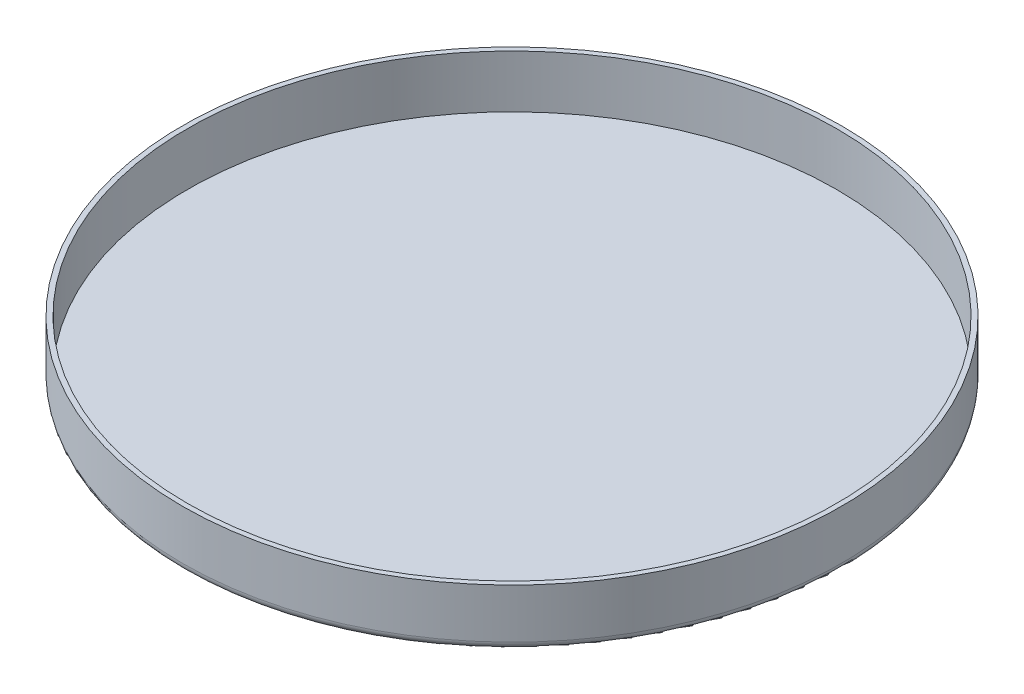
ISO-10303-21;
HEADER;
FILE_DESCRIPTION(('STEP AP214'),'2;1');
FILE_NAME('part.step','',(''),(''),'','','');
FILE_SCHEMA(('AUTOMOTIVE_DESIGN { 1 0 10303 214 1 1 1 1 }'));
ENDSEC;
DATA;
#1=APPLICATION_CONTEXT('core data for automotive mechanical design processes');
#2=APPLICATION_PROTOCOL_DEFINITION('international standard','automotive_design',2000,#1);
#3=PRODUCT_CONTEXT('',#1,'mechanical');
#4=PRODUCT('Part','Part','',(#3));
#5=PRODUCT_RELATED_PRODUCT_CATEGORY('part','',(#4));
#6=PRODUCT_DEFINITION_FORMATION('','',#4);
#7=PRODUCT_DEFINITION_CONTEXT('part definition',#1,'design');
#8=PRODUCT_DEFINITION('design','',#6,#7);
#9=PRODUCT_DEFINITION_SHAPE('','',#8);
#10=(LENGTH_UNIT() NAMED_UNIT(*) SI_UNIT(.MILLI.,.METRE.));
#11=(NAMED_UNIT(*) PLANE_ANGLE_UNIT() SI_UNIT($,.RADIAN.));
#12=(NAMED_UNIT(*) SI_UNIT($,.STERADIAN.) SOLID_ANGLE_UNIT());
#13=UNCERTAINTY_MEASURE_WITH_UNIT(LENGTH_MEASURE(1.E-05),#10,'distance_accuracy_value','');
#14=(GEOMETRIC_REPRESENTATION_CONTEXT(3) GLOBAL_UNCERTAINTY_ASSIGNED_CONTEXT((#13)) GLOBAL_UNIT_ASSIGNED_CONTEXT((#10,
#11,#12)) REPRESENTATION_CONTEXT('',''));
#15=CARTESIAN_POINT('',(0.,0.,0.));
#16=DIRECTION('',(0.,0.,1.));
#17=DIRECTION('',(1.,0.,0.));
#18=AXIS2_PLACEMENT_3D('',#15,#16,#17);
#19=CARTESIAN_POINT('',(0.,35.,0.));
#20=DIRECTION('',(0.,-1.,0.));
#21=DIRECTION('',(0.,0.,-1.));
#22=AXIS2_PLACEMENT_3D('',#19,#20,#21);
#23=CYLINDRICAL_SURFACE('',#22,200.);
#24=CARTESIAN_POINT('',(0.,5.,0.));
#25=DIRECTION('',(0.,1.,0.));
#26=DIRECTION('',(0.,0.,1.));
#27=AXIS2_PLACEMENT_3D('',#24,#25,#26);
#28=CIRCLE('',#27,200.);
#29=CARTESIAN_POINT('',(0.,5.,200.));
#30=VERTEX_POINT('',#29);
#31=EDGE_CURVE('E36',#30,#30,#28,.T.);
#32=ORIENTED_EDGE('',*,*,#31,.T.);
#33=EDGE_LOOP('',(#32));
#34=FACE_BOUND('',#33,.T.);
#35=CARTESIAN_POINT('',(0.,35.,0.));
#36=DIRECTION('',(0.,1.,0.));
#37=DIRECTION('',(0.,0.,1.));
#38=AXIS2_PLACEMENT_3D('',#35,#36,#37);
#39=CIRCLE('',#38,200.);
#40=CARTESIAN_POINT('',(0.,35.,200.));
#41=VERTEX_POINT('',#40);
#42=EDGE_CURVE('E40',#41,#41,#39,.T.);
#43=ORIENTED_EDGE('',*,*,#42,.F.);
#44=EDGE_LOOP('',(#43));
#45=FACE_BOUND('',#44,.T.);
#46=ADVANCED_FACE('F29',(#34,#45),#23,.T.);
#47=CARTESIAN_POINT('',(0.,35.,0.));
#48=DIRECTION('',(0.,1.,0.));
#49=DIRECTION('',(0.,0.,1.));
#50=AXIS2_PLACEMENT_3D('',#47,#48,#49);
#51=PLANE('',#50);
#52=CARTESIAN_POINT('',(0.,35.,0.));
#53=DIRECTION('',(0.,1.,0.));
#54=DIRECTION('',(0.,0.,1.));
#55=AXIS2_PLACEMENT_3D('',#52,#53,#54);
#56=CIRCLE('',#55,197.);
#57=CARTESIAN_POINT('',(0.,35.,197.));
#58=VERTEX_POINT('',#57);
#59=EDGE_CURVE('E44',#58,#58,#56,.T.);
#60=ORIENTED_EDGE('',*,*,#59,.F.);
#61=EDGE_LOOP('',(#60));
#62=FACE_BOUND('',#61,.T.);
#63=ORIENTED_EDGE('',*,*,#42,.T.);
#64=EDGE_LOOP('',(#63));
#65=FACE_BOUND('',#64,.T.);
#66=ADVANCED_FACE('F65',(#62,#65),#51,.T.);
#67=CARTESIAN_POINT('',(0.,0.,0.));
#68=DIRECTION('',(0.,1.,0.));
#69=DIRECTION('',(0.,0.,1.));
#70=AXIS2_PLACEMENT_3D('',#67,#68,#69);
#71=PLANE('',#70);
#72=CARTESIAN_POINT('',(0.,0.,0.));
#73=DIRECTION('',(0.,1.,0.));
#74=DIRECTION('',(0.,0.,1.));
#75=AXIS2_PLACEMENT_3D('',#72,#73,#74);
#76=CIRCLE('',#75,195.);
#77=CARTESIAN_POINT('',(0.,0.,195.));
#78=VERTEX_POINT('',#77);
#79=EDGE_CURVE('E10',#78,#78,#76,.F.);
#80=ORIENTED_EDGE('',*,*,#79,.T.);
#81=EDGE_LOOP('',(#80));
#82=FACE_BOUND('',#81,.T.);
#83=ADVANCED_FACE('F57',(#82),#71,.F.);
#84=CARTESIAN_POINT('',(0.,35.,0.));
#85=DIRECTION('',(0.,-1.,0.));
#86=DIRECTION('',(0.,0.,-1.));
#87=AXIS2_PLACEMENT_3D('',#84,#85,#86);
#88=CYLINDRICAL_SURFACE('',#87,197.);
#89=ORIENTED_EDGE('',*,*,#59,.T.);
#90=EDGE_LOOP('',(#89));
#91=FACE_BOUND('',#90,.T.);
#92=CARTESIAN_POINT('',(0.,3.,0.));
#93=DIRECTION('',(0.,1.,0.));
#94=DIRECTION('',(0.,0.,1.));
#95=AXIS2_PLACEMENT_3D('',#92,#93,#94);
#96=CIRCLE('',#95,197.);
#97=CARTESIAN_POINT('',(0.,3.,197.));
#98=VERTEX_POINT('',#97);
#99=EDGE_CURVE('E49',#98,#98,#96,.T.);
#100=ORIENTED_EDGE('',*,*,#99,.F.);
#101=EDGE_LOOP('',(#100));
#102=FACE_BOUND('',#101,.T.);
#103=ADVANCED_FACE('F55',(#91,#102),#88,.F.);
#104=CARTESIAN_POINT('',(0.,3.,0.));
#105=DIRECTION('',(0.,1.,0.));
#106=DIRECTION('',(0.,0.,1.));
#107=AXIS2_PLACEMENT_3D('',#104,#105,#106);
#108=PLANE('',#107);
#109=ORIENTED_EDGE('',*,*,#99,.T.);
#110=EDGE_LOOP('',(#109));
#111=FACE_BOUND('',#110,.T.);
#112=ADVANCED_FACE('F53',(#111),#108,.T.);
#113=CARTESIAN_POINT('',(0.,5.,0.));
#114=DIRECTION('',(0.,1.,0.));
#115=DIRECTION('',(0.,0.,1.));
#116=AXIS2_PLACEMENT_3D('',#113,#114,#115);
#117=TOROIDAL_SURFACE('',#116,195.,5.);
#118=ORIENTED_EDGE('',*,*,#79,.F.);
#119=EDGE_LOOP('',(#118));
#120=FACE_BOUND('',#119,.T.);
#121=ORIENTED_EDGE('',*,*,#31,.F.);
#122=EDGE_LOOP('',(#121));
#123=FACE_BOUND('',#122,.T.);
#124=ADVANCED_FACE('F31',(#120,#123),#117,.T.);
#125=CLOSED_SHELL('',(#46,#66,#83,#103,#112,#124));
#126=MANIFOLD_SOLID_BREP('B2',#125);
#127=ADVANCED_BREP_SHAPE_REPRESENTATION('',(#18,#126),#14);
#128=SHAPE_DEFINITION_REPRESENTATION(#9,#127);
ENDSEC;
END-ISO-10303-21;
